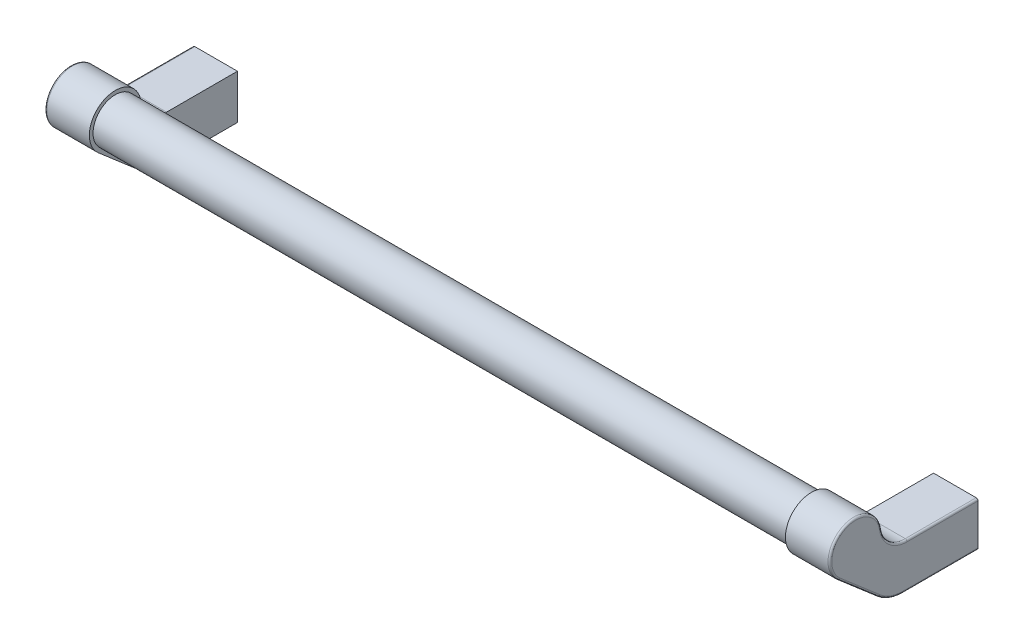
ISO-10303-21;
HEADER;
FILE_DESCRIPTION(('STEP AP214'),'2;1');
FILE_NAME('part.step','',(''),(''),'','','');
FILE_SCHEMA(('AUTOMOTIVE_DESIGN { 1 0 10303 214 1 1 1 1 }'));
ENDSEC;
DATA;
#1=APPLICATION_CONTEXT('core data for automotive mechanical design processes');
#2=APPLICATION_PROTOCOL_DEFINITION('international standard','automotive_design',2000,#1);
#3=PRODUCT_CONTEXT('',#1,'mechanical');
#4=PRODUCT('Part','Part','',(#3));
#5=PRODUCT_RELATED_PRODUCT_CATEGORY('part','',(#4));
#6=PRODUCT_DEFINITION_FORMATION('','',#4);
#7=PRODUCT_DEFINITION_CONTEXT('part definition',#1,'design');
#8=PRODUCT_DEFINITION('design','',#6,#7);
#9=PRODUCT_DEFINITION_SHAPE('','',#8);
#10=(LENGTH_UNIT() NAMED_UNIT(*) SI_UNIT(.MILLI.,.METRE.));
#11=(NAMED_UNIT(*) PLANE_ANGLE_UNIT() SI_UNIT($,.RADIAN.));
#12=(NAMED_UNIT(*) SI_UNIT($,.STERADIAN.) SOLID_ANGLE_UNIT());
#13=UNCERTAINTY_MEASURE_WITH_UNIT(LENGTH_MEASURE(1.E-05),#10,'distance_accuracy_value','');
#14=(GEOMETRIC_REPRESENTATION_CONTEXT(3) GLOBAL_UNCERTAINTY_ASSIGNED_CONTEXT((#13)) GLOBAL_UNIT_ASSIGNED_CONTEXT((#10,
#11,#12)) REPRESENTATION_CONTEXT('',''));
#15=CARTESIAN_POINT('',(0.,0.,0.));
#16=DIRECTION('',(0.,0.,1.));
#17=DIRECTION('',(1.,0.,0.));
#18=AXIS2_PLACEMENT_3D('',#15,#16,#17);
#19=CARTESIAN_POINT('',(200.,0.,6.));
#20=DIRECTION('',(0.,0.,-1.));
#21=DIRECTION('',(-1.,0.,0.));
#22=AXIS2_PLACEMENT_3D('',#19,#20,#21);
#23=PLANE('',#22);
#24=CARTESIAN_POINT('',(200.,0.,6.));
#25=DIRECTION('',(0.,0.,-1.));
#26=DIRECTION('',(-1.,0.,0.));
#27=AXIS2_PLACEMENT_3D('',#24,#25,#26);
#28=CIRCLE('',#27,2.);
#29=CARTESIAN_POINT('',(198.,0.,6.));
#30=VERTEX_POINT('',#29);
#31=EDGE_CURVE('E124',#30,#30,#28,.T.);
#32=ORIENTED_EDGE('',*,*,#31,.T.);
#33=EDGE_LOOP('',(#32));
#34=FACE_BOUND('',#33,.T.);
#35=ADVANCED_FACE('F14',(#34),#23,.T.);
#36=CARTESIAN_POINT('',(205.5,13.,19.143593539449));
#37=DIRECTION('',(-1.,0.,0.));
#38=DIRECTION('',(0.,-1.,0.));
#39=AXIS2_PLACEMENT_3D('',#36,#37,#38);
#40=TOROIDAL_SURFACE('',#39,7.5,0.5);
#41=CARTESIAN_POINT('',(205.5,5.5,19.143593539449));
#42=DIRECTION('',(0.,0.,1.));
#43=DIRECTION('',(1.,0.,0.));
#44=AXIS2_PLACEMENT_3D('',#41,#42,#43);
#45=CIRCLE('',#44,0.5);
#46=CARTESIAN_POINT('',(205.5,6.,19.143593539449));
#47=VERTEX_POINT('',#46);
#48=CARTESIAN_POINT('',(206.,5.5,19.143593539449));
#49=VERTEX_POINT('',#48);
#50=EDGE_CURVE('E275',#47,#49,#45,.F.);
#51=ORIENTED_EDGE('',*,*,#50,.F.);
#52=CARTESIAN_POINT('',(205.5,13.,19.143593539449));
#53=DIRECTION('',(-1.,0.,0.));
#54=DIRECTION('',(0.,-1.,0.));
#55=AXIS2_PLACEMENT_3D('',#52,#53,#54);
#56=CIRCLE('',#55,7.);
#57=CARTESIAN_POINT('',(205.5,12.,26.0717967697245));
#58=VERTEX_POINT('',#57);
#59=EDGE_CURVE('E102',#47,#58,#56,.T.);
#60=ORIENTED_EDGE('',*,*,#59,.T.);
#61=CARTESIAN_POINT('',(205.5,11.9285714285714,26.5666684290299));
#62=DIRECTION('',(0.,0.989743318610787,0.142857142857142));
#63=DIRECTION('',(0.,-0.142857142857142,0.989743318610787));
#64=AXIS2_PLACEMENT_3D('',#61,#62,#63);
#65=CIRCLE('',#64,0.5);
#66=CARTESIAN_POINT('',(206.,11.9285714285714,26.5666684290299));
#67=VERTEX_POINT('',#66);
#68=EDGE_CURVE('E106',#58,#67,#65,.F.);
#69=ORIENTED_EDGE('',*,*,#68,.T.);
#70=CARTESIAN_POINT('',(206.,13.,19.143593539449));
#71=DIRECTION('',(1.,0.,0.));
#72=DIRECTION('',(0.,-0.142857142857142,0.989743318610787));
#73=AXIS2_PLACEMENT_3D('',#70,#71,#72);
#74=CIRCLE('',#73,7.5);
#75=EDGE_CURVE('E292',#67,#49,#74,.T.);
#76=ORIENTED_EDGE('',*,*,#75,.T.);
#77=EDGE_LOOP('',(#51,#60,#69,#76));
#78=FACE_BOUND('',#77,.T.);
#79=ADVANCED_FACE('F161',(#78),#40,.T.);
#80=CARTESIAN_POINT('',(205.5,11.,33.));
#81=DIRECTION('',(-1.,0.,0.));
#82=DIRECTION('',(0.,-1.,0.));
#83=AXIS2_PLACEMENT_3D('',#80,#81,#82);
#84=TOROIDAL_SURFACE('',#83,6.5,0.5);
#85=ORIENTED_EDGE('',*,*,#68,.F.);
#86=CARTESIAN_POINT('',(205.5,11.,33.));
#87=DIRECTION('',(-1.,0.,0.));
#88=DIRECTION('',(0.,-1.,0.));
#89=AXIS2_PLACEMENT_3D('',#86,#87,#88);
#90=CIRCLE('',#89,7.);
#91=CARTESIAN_POINT('',(205.5,5.69800597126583,37.5704331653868));
#92=VERTEX_POINT('',#91);
#93=EDGE_CURVE('E113',#58,#92,#90,.F.);
#94=ORIENTED_EDGE('',*,*,#93,.T.);
#95=CARTESIAN_POINT('',(205.5,6.07671983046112,37.2439736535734));
#96=DIRECTION('',(0.,0.652919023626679,0.757427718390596));
#97=DIRECTION('',(0.,-0.757427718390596,0.652919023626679));
#98=AXIS2_PLACEMENT_3D('',#95,#96,#97);
#99=CIRCLE('',#98,0.5);
#100=CARTESIAN_POINT('',(206.,6.07671983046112,37.2439736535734));
#101=VERTEX_POINT('',#100);
#102=EDGE_CURVE('E116',#92,#101,#99,.T.);
#103=ORIENTED_EDGE('',*,*,#102,.T.);
#104=CARTESIAN_POINT('',(206.,11.,33.));
#105=DIRECTION('',(-1.,0.,0.));
#106=DIRECTION('',(0.,-0.757427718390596,0.652919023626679));
#107=AXIS2_PLACEMENT_3D('',#104,#105,#106);
#108=CIRCLE('',#107,6.5);
#109=EDGE_CURVE('E309',#101,#67,#108,.T.);
#110=ORIENTED_EDGE('',*,*,#109,.T.);
#111=EDGE_LOOP('',(#85,#94,#103,#110));
#112=FACE_BOUND('',#111,.T.);
#113=ADVANCED_FACE('F167',(#112),#84,.T.);
#114=CARTESIAN_POINT('',(205.5,0.0767934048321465,30.2836762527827));
#115=DIRECTION('',(0.,-0.65291902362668,-0.757427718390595));
#116=DIRECTION('',(0.,0.757427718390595,-0.65291902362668));
#117=AXIS2_PLACEMENT_3D('',#114,#115,#116);
#118=CYLINDRICAL_SURFACE('',#117,0.5);
#119=ORIENTED_EDGE('',*,*,#102,.F.);
#120=DIRECTION('',(0.,-0.65291902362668,-0.757427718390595));
#121=VECTOR('',#120,1.);
#122=CARTESIAN_POINT('',(205.5,-0.301920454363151,30.610135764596));
#123=LINE('',#122,#121);
#124=CARTESIAN_POINT('',(205.5,-3.57427718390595,26.8139932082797));
#125=VERTEX_POINT('',#124);
#126=EDGE_CURVE('E119',#92,#125,#123,.T.);
#127=ORIENTED_EDGE('',*,*,#126,.T.);
#128=CARTESIAN_POINT('',(205.5,-3.19556332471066,26.4875336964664));
#129=DIRECTION('',(0.,-0.65291902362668,-0.757427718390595));
#130=DIRECTION('',(0.,0.757427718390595,-0.65291902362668));
#131=AXIS2_PLACEMENT_3D('',#128,#129,#130);
#132=CIRCLE('',#131,0.5);
#133=CARTESIAN_POINT('',(206.,-3.19556332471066,26.4875336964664));
#134=VERTEX_POINT('',#133);
#135=EDGE_CURVE('E122',#125,#134,#132,.F.);
#136=ORIENTED_EDGE('',*,*,#135,.T.);
#137=DIRECTION('',(0.,0.65291902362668,0.757427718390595));
#138=VECTOR('',#137,1.);
#139=CARTESIAN_POINT('',(206.,-3.19556332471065,26.4875336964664));
#140=LINE('',#139,#138);
#141=EDGE_CURVE('E316',#134,#101,#140,.T.);
#142=ORIENTED_EDGE('',*,*,#141,.T.);
#143=EDGE_LOOP('',(#119,#127,#136,#142));
#144=FACE_BOUND('',#143,.T.);
#145=ADVANCED_FACE('F221',(#144),#118,.T.);
#146=CARTESIAN_POINT('',(205.5,4.,20.284802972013));
#147=DIRECTION('',(-1.,0.,0.));
#148=DIRECTION('',(0.,-1.,0.));
#149=AXIS2_PLACEMENT_3D('',#146,#147,#148);
#150=TOROIDAL_SURFACE('',#149,9.5,0.5);
#151=ORIENTED_EDGE('',*,*,#135,.F.);
#152=CARTESIAN_POINT('',(205.5,4.,20.284802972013));
#153=DIRECTION('',(-1.,0.,0.));
#154=DIRECTION('',(0.,-1.,0.));
#155=AXIS2_PLACEMENT_3D('',#152,#153,#154);
#156=CIRCLE('',#155,10.);
#157=CARTESIAN_POINT('',(205.5,-6.,20.284802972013));
#158=VERTEX_POINT('',#157);
#159=EDGE_CURVE('E125',#125,#158,#156,.F.);
#160=ORIENTED_EDGE('',*,*,#159,.T.);
#161=CARTESIAN_POINT('',(205.5,-5.5,20.284802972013));
#162=DIRECTION('',(0.,0.,1.));
#163=DIRECTION('',(0.,-1.,0.));
#164=AXIS2_PLACEMENT_3D('',#161,#162,#163);
#165=CIRCLE('',#164,0.5);
#166=CARTESIAN_POINT('',(206.,-5.5,20.284802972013));
#167=VERTEX_POINT('',#166);
#168=EDGE_CURVE('E126',#158,#167,#165,.T.);
#169=ORIENTED_EDGE('',*,*,#168,.T.);
#170=CARTESIAN_POINT('',(206.,4.,20.284802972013));
#171=DIRECTION('',(-1.,0.,0.));
#172=DIRECTION('',(0.,-1.,0.));
#173=AXIS2_PLACEMENT_3D('',#170,#171,#172);
#174=CIRCLE('',#173,9.5);
#175=EDGE_CURVE('E262',#167,#134,#174,.T.);
#176=ORIENTED_EDGE('',*,*,#175,.T.);
#177=EDGE_LOOP('',(#151,#160,#169,#176));
#178=FACE_BOUND('',#177,.T.);
#179=ADVANCED_FACE('F215',(#178),#150,.T.);
#180=CARTESIAN_POINT('',(205.5,-5.5,19.143593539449));
#181=DIRECTION('',(0.,0.,-1.));
#182=DIRECTION('',(-1.,0.,0.));
#183=AXIS2_PLACEMENT_3D('',#180,#181,#182);
#184=CYLINDRICAL_SURFACE('',#183,0.5);
#185=ORIENTED_EDGE('',*,*,#168,.F.);
#186=DIRECTION('',(0.,0.,-1.));
#187=VECTOR('',#186,1.);
#188=CARTESIAN_POINT('',(205.5,-6.,19.143593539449));
#189=LINE('',#188,#187);
#190=CARTESIAN_POINT('',(205.5,-6.,0.));
#191=VERTEX_POINT('',#190);
#192=EDGE_CURVE('E86',#158,#191,#189,.T.);
#193=ORIENTED_EDGE('',*,*,#192,.T.);
#194=CARTESIAN_POINT('',(205.5,-5.5,0.));
#195=DIRECTION('',(0.,0.,-1.));
#196=DIRECTION('',(-1.,0.,0.));
#197=AXIS2_PLACEMENT_3D('',#194,#195,#196);
#198=CIRCLE('',#197,0.5);
#199=CARTESIAN_POINT('',(206.,-5.5,0.));
#200=VERTEX_POINT('',#199);
#201=EDGE_CURVE('E130',#191,#200,#198,.F.);
#202=ORIENTED_EDGE('',*,*,#201,.T.);
#203=DIRECTION('',(0.,0.,1.));
#204=VECTOR('',#203,1.);
#205=CARTESIAN_POINT('',(206.,-5.5,19.143593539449));
#206=LINE('',#205,#204);
#207=EDGE_CURVE('E319',#200,#167,#206,.T.);
#208=ORIENTED_EDGE('',*,*,#207,.T.);
#209=EDGE_LOOP('',(#185,#193,#202,#208));
#210=FACE_BOUND('',#209,.T.);
#211=ADVANCED_FACE('F184',(#210),#184,.T.);
#212=CARTESIAN_POINT('',(206.,13.,19.143593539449));
#213=DIRECTION('',(-1.,0.,0.));
#214=DIRECTION('',(0.,-1.,0.));
#215=AXIS2_PLACEMENT_3D('',#212,#213,#214);
#216=PLANE('',#215);
#217=DIRECTION('',(0.,0.,1.));
#218=VECTOR('',#217,1.);
#219=CARTESIAN_POINT('',(206.,5.5,19.143593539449));
#220=LINE('',#219,#218);
#221=CARTESIAN_POINT('',(206.,5.5,0.));
#222=VERTEX_POINT('',#221);
#223=EDGE_CURVE('E312',#49,#222,#220,.F.);
#224=ORIENTED_EDGE('',*,*,#223,.F.);
#225=ORIENTED_EDGE('',*,*,#75,.F.);
#226=ORIENTED_EDGE('',*,*,#109,.F.);
#227=ORIENTED_EDGE('',*,*,#141,.F.);
#228=ORIENTED_EDGE('',*,*,#175,.F.);
#229=ORIENTED_EDGE('',*,*,#207,.F.);
#230=DIRECTION('',(0.,-1.,0.));
#231=VECTOR('',#230,1.);
#232=CARTESIAN_POINT('',(206.,13.,0.));
#233=LINE('',#232,#231);
#234=EDGE_CURVE('E139',#222,#200,#233,.T.);
#235=ORIENTED_EDGE('',*,*,#234,.F.);
#236=EDGE_LOOP('',(#224,#225,#226,#227,#228,#229,#235));
#237=FACE_BOUND('',#236,.T.);
#238=ADVANCED_FACE('F175',(#237),#216,.F.);
#239=CARTESIAN_POINT('',(200.,0.,6.));
#240=DIRECTION('',(0.,0.,-1.));
#241=DIRECTION('',(-1.,0.,0.));
#242=AXIS2_PLACEMENT_3D('',#239,#240,#241);
#243=CYLINDRICAL_SURFACE('',#242,2.);
#244=CARTESIAN_POINT('',(200.,0.,0.400000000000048));
#245=DIRECTION('',(0.,0.,1.));
#246=DIRECTION('',(1.,0.,0.));
#247=AXIS2_PLACEMENT_3D('',#244,#245,#246);
#248=CIRCLE('',#247,2.);
#249=CARTESIAN_POINT('',(202.,0.,0.400000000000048));
#250=VERTEX_POINT('',#249);
#251=EDGE_CURVE('E23',#250,#250,#248,.F.);
#252=ORIENTED_EDGE('',*,*,#251,.T.);
#253=EDGE_LOOP('',(#252));
#254=FACE_BOUND('',#253,.T.);
#255=ORIENTED_EDGE('',*,*,#31,.F.);
#256=EDGE_LOOP('',(#255));
#257=FACE_BOUND('',#256,.T.);
#258=ADVANCED_FACE('F147',(#254,#257),#243,.F.);
#259=CARTESIAN_POINT('',(205.5,5.5,19.143593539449));
#260=DIRECTION('',(0.,0.,1.));
#261=DIRECTION('',(1.,0.,0.));
#262=AXIS2_PLACEMENT_3D('',#259,#260,#261);
#263=CYLINDRICAL_SURFACE('',#262,0.5);
#264=ORIENTED_EDGE('',*,*,#50,.T.);
#265=ORIENTED_EDGE('',*,*,#223,.T.);
#266=CARTESIAN_POINT('',(205.5,5.5,0.));
#267=DIRECTION('',(0.,0.,1.));
#268=DIRECTION('',(1.,0.,0.));
#269=AXIS2_PLACEMENT_3D('',#266,#267,#268);
#270=CIRCLE('',#269,0.5);
#271=CARTESIAN_POINT('',(205.5,6.,0.));
#272=VERTEX_POINT('',#271);
#273=EDGE_CURVE('E31',#222,#272,#270,.T.);
#274=ORIENTED_EDGE('',*,*,#273,.T.);
#275=DIRECTION('',(0.,0.,1.));
#276=VECTOR('',#275,1.);
#277=CARTESIAN_POINT('',(205.5,6.,19.143593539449));
#278=LINE('',#277,#276);
#279=EDGE_CURVE('E105',#272,#47,#278,.T.);
#280=ORIENTED_EDGE('',*,*,#279,.T.);
#281=EDGE_LOOP('',(#264,#265,#274,#280));
#282=FACE_BOUND('',#281,.T.);
#283=ADVANCED_FACE('F170',(#282),#263,.T.);
#284=CARTESIAN_POINT('',(206.,13.,19.143593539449));
#285=DIRECTION('',(-1.,0.,0.));
#286=DIRECTION('',(0.,-1.,0.));
#287=AXIS2_PLACEMENT_3D('',#284,#285,#286);
#288=CYLINDRICAL_SURFACE('',#287,7.);
#289=ORIENTED_EDGE('',*,*,#59,.F.);
#290=DIRECTION('',(1.,0.,0.));
#291=VECTOR('',#290,1.);
#292=CARTESIAN_POINT('',(206.,6.,19.143593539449));
#293=LINE('',#292,#291);
#294=CARTESIAN_POINT('',(194.,6.,19.143593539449));
#295=VERTEX_POINT('',#294);
#296=EDGE_CURVE('E107',#47,#295,#293,.F.);
#297=ORIENTED_EDGE('',*,*,#296,.T.);
#298=CARTESIAN_POINT('',(194.,13.,19.143593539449));
#299=DIRECTION('',(-1.,0.,0.));
#300=DIRECTION('',(0.,-1.,0.));
#301=AXIS2_PLACEMENT_3D('',#298,#299,#300);
#302=CIRCLE('',#301,7.);
#303=CARTESIAN_POINT('',(194.,12.,26.0717967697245));
#304=VERTEX_POINT('',#303);
#305=EDGE_CURVE('E95',#304,#295,#302,.F.);
#306=ORIENTED_EDGE('',*,*,#305,.F.);
#307=DIRECTION('',(-1.,0.,0.));
#308=VECTOR('',#307,1.);
#309=CARTESIAN_POINT('',(206.,12.,26.0717967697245));
#310=LINE('',#309,#308);
#311=EDGE_CURVE('E78',#58,#304,#310,.T.);
#312=ORIENTED_EDGE('',*,*,#311,.F.);
#313=EDGE_LOOP('',(#289,#297,#306,#312));
#314=FACE_BOUND('',#313,.T.);
#315=ADVANCED_FACE('F180',(#314),#288,.F.);
#316=CARTESIAN_POINT('',(206.,11.,33.));
#317=DIRECTION('',(-1.,0.,0.));
#318=DIRECTION('',(0.,-1.,0.));
#319=AXIS2_PLACEMENT_3D('',#316,#317,#318);
#320=CYLINDRICAL_SURFACE('',#319,7.);
#321=ORIENTED_EDGE('',*,*,#311,.T.);
#322=CARTESIAN_POINT('',(194.,11.,33.));
#323=DIRECTION('',(-1.,0.,0.));
#324=DIRECTION('',(0.,-1.,0.));
#325=AXIS2_PLACEMENT_3D('',#322,#323,#324);
#326=CIRCLE('',#325,7.);
#327=CARTESIAN_POINT('',(194.,5.69800597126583,37.5704331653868));
#328=VERTEX_POINT('',#327);
#329=EDGE_CURVE('E97',#328,#304,#326,.T.);
#330=ORIENTED_EDGE('',*,*,#329,.F.);
#331=DIRECTION('',(-1.,0.,0.));
#332=VECTOR('',#331,1.);
#333=CARTESIAN_POINT('',(206.,5.69800597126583,37.5704331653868));
#334=LINE('',#333,#332);
#335=EDGE_CURVE('E112',#328,#92,#334,.F.);
#336=ORIENTED_EDGE('',*,*,#335,.T.);
#337=ORIENTED_EDGE('',*,*,#93,.F.);
#338=EDGE_LOOP('',(#321,#330,#336,#337));
#339=FACE_BOUND('',#338,.T.);
#340=ADVANCED_FACE('F197',(#339),#320,.T.);
#341=CARTESIAN_POINT('',(206.,-3.57427718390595,26.8139932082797));
#342=DIRECTION('',(0.,0.757427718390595,-0.65291902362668));
#343=DIRECTION('',(0.,0.65291902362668,0.757427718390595));
#344=AXIS2_PLACEMENT_3D('',#341,#342,#343);
#345=PLANE('',#344);
#346=ORIENTED_EDGE('',*,*,#126,.F.);
#347=ORIENTED_EDGE('',*,*,#335,.F.);
#348=DIRECTION('',(0.,0.65291902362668,0.757427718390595));
#349=VECTOR('',#348,1.);
#350=CARTESIAN_POINT('',(194.,-3.57427718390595,26.8139932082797));
#351=LINE('',#350,#349);
#352=CARTESIAN_POINT('',(194.,-3.57427718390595,26.8139932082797));
#353=VERTEX_POINT('',#352);
#354=EDGE_CURVE('E77',#353,#328,#351,.T.);
#355=ORIENTED_EDGE('',*,*,#354,.F.);
#356=DIRECTION('',(1.,0.,0.));
#357=VECTOR('',#356,1.);
#358=CARTESIAN_POINT('',(206.,-3.57427718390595,26.8139932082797));
#359=LINE('',#358,#357);
#360=EDGE_CURVE('E73',#125,#353,#359,.F.);
#361=ORIENTED_EDGE('',*,*,#360,.F.);
#362=EDGE_LOOP('',(#346,#347,#355,#361));
#363=FACE_BOUND('',#362,.T.);
#364=ADVANCED_FACE('F190',(#363),#345,.F.);
#365=CARTESIAN_POINT('',(206.,4.,20.284802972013));
#366=DIRECTION('',(-1.,0.,0.));
#367=DIRECTION('',(0.,-1.,0.));
#368=AXIS2_PLACEMENT_3D('',#365,#366,#367);
#369=CYLINDRICAL_SURFACE('',#368,10.);
#370=ORIENTED_EDGE('',*,*,#360,.T.);
#371=CARTESIAN_POINT('',(194.,4.,20.284802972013));
#372=DIRECTION('',(-1.,0.,0.));
#373=DIRECTION('',(0.,-1.,0.));
#374=AXIS2_PLACEMENT_3D('',#371,#372,#373);
#375=CIRCLE('',#374,10.);
#376=CARTESIAN_POINT('',(194.,-6.,20.284802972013));
#377=VERTEX_POINT('',#376);
#378=EDGE_CURVE('E66',#377,#353,#375,.T.);
#379=ORIENTED_EDGE('',*,*,#378,.F.);
#380=DIRECTION('',(-1.,0.,0.));
#381=VECTOR('',#380,1.);
#382=CARTESIAN_POINT('',(206.,-6.,20.284802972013));
#383=LINE('',#382,#381);
#384=EDGE_CURVE('E70',#377,#158,#383,.F.);
#385=ORIENTED_EDGE('',*,*,#384,.T.);
#386=ORIENTED_EDGE('',*,*,#159,.F.);
#387=EDGE_LOOP('',(#370,#379,#385,#386));
#388=FACE_BOUND('',#387,.T.);
#389=ADVANCED_FACE('F68',(#388),#369,.T.);
#390=CARTESIAN_POINT('',(206.,-6.,20.284802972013));
#391=DIRECTION('',(0.,1.,0.));
#392=DIRECTION('',(-1.,0.,0.));
#393=AXIS2_PLACEMENT_3D('',#390,#391,#392);
#394=PLANE('',#393);
#395=ORIENTED_EDGE('',*,*,#192,.F.);
#396=ORIENTED_EDGE('',*,*,#384,.F.);
#397=DIRECTION('',(0.,0.,1.));
#398=VECTOR('',#397,1.);
#399=CARTESIAN_POINT('',(194.,-6.,20.284802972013));
#400=LINE('',#399,#398);
#401=CARTESIAN_POINT('',(194.,-6.,0.));
#402=VERTEX_POINT('',#401);
#403=EDGE_CURVE('E84',#402,#377,#400,.T.);
#404=ORIENTED_EDGE('',*,*,#403,.F.);
#405=DIRECTION('',(1.,0.,0.));
#406=VECTOR('',#405,1.);
#407=CARTESIAN_POINT('',(206.,-6.,0.));
#408=LINE('',#407,#406);
#409=EDGE_CURVE('E132',#402,#191,#408,.T.);
#410=ORIENTED_EDGE('',*,*,#409,.T.);
#411=EDGE_LOOP('',(#395,#396,#404,#410));
#412=FACE_BOUND('',#411,.T.);
#413=ADVANCED_FACE('F82',(#412),#394,.F.);
#414=CARTESIAN_POINT('',(206.,-6.,0.));
#415=DIRECTION('',(0.,0.,1.));
#416=DIRECTION('',(1.,0.,0.));
#417=AXIS2_PLACEMENT_3D('',#414,#415,#416);
#418=PLANE('',#417);
#419=CARTESIAN_POINT('',(200.,0.,0.));
#420=DIRECTION('',(0.,0.,1.));
#421=DIRECTION('',(1.,0.,0.));
#422=AXIS2_PLACEMENT_3D('',#419,#420,#421);
#423=CIRCLE('',#422,2.40000000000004);
#424=CARTESIAN_POINT('',(202.4,0.,0.));
#425=VERTEX_POINT('',#424);
#426=EDGE_CURVE('E9',#425,#425,#423,.T.);
#427=ORIENTED_EDGE('',*,*,#426,.T.);
#428=EDGE_LOOP('',(#427));
#429=FACE_BOUND('',#428,.T.);
#430=ORIENTED_EDGE('',*,*,#273,.F.);
#431=ORIENTED_EDGE('',*,*,#234,.T.);
#432=ORIENTED_EDGE('',*,*,#201,.F.);
#433=ORIENTED_EDGE('',*,*,#409,.F.);
#434=DIRECTION('',(0.,1.,0.));
#435=VECTOR('',#434,1.);
#436=CARTESIAN_POINT('',(194.,-6.,0.));
#437=LINE('',#436,#435);
#438=CARTESIAN_POINT('',(194.,6.,0.));
#439=VERTEX_POINT('',#438);
#440=EDGE_CURVE('E94',#439,#402,#437,.F.);
#441=ORIENTED_EDGE('',*,*,#440,.F.);
#442=DIRECTION('',(1.,0.,0.));
#443=VECTOR('',#442,1.);
#444=CARTESIAN_POINT('',(206.,6.,0.));
#445=LINE('',#444,#443);
#446=EDGE_CURVE('E129',#272,#439,#445,.F.);
#447=ORIENTED_EDGE('',*,*,#446,.F.);
#448=EDGE_LOOP('',(#430,#431,#432,#433,#441,#447));
#449=FACE_BOUND('',#448,.T.);
#450=ADVANCED_FACE('F183',(#429,#449),#418,.F.);
#451=CARTESIAN_POINT('',(206.,6.,0.));
#452=DIRECTION('',(0.,-1.,0.));
#453=DIRECTION('',(1.,0.,0.));
#454=AXIS2_PLACEMENT_3D('',#451,#452,#453);
#455=PLANE('',#454);
#456=ORIENTED_EDGE('',*,*,#279,.F.);
#457=ORIENTED_EDGE('',*,*,#446,.T.);
#458=DIRECTION('',(0.,0.,1.));
#459=VECTOR('',#458,1.);
#460=CARTESIAN_POINT('',(194.,6.,0.));
#461=LINE('',#460,#459);
#462=EDGE_CURVE('E88',#295,#439,#461,.F.);
#463=ORIENTED_EDGE('',*,*,#462,.F.);
#464=ORIENTED_EDGE('',*,*,#296,.F.);
#465=EDGE_LOOP('',(#456,#457,#463,#464));
#466=FACE_BOUND('',#465,.T.);
#467=ADVANCED_FACE('F196',(#466),#455,.F.);
#468=CARTESIAN_POINT('',(194.,13.,19.143593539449));
#469=DIRECTION('',(-1.,0.,0.));
#470=DIRECTION('',(0.,-1.,0.));
#471=AXIS2_PLACEMENT_3D('',#468,#469,#470);
#472=PLANE('',#471);
#473=CARTESIAN_POINT('',(194.,11.,33.));
#474=DIRECTION('',(-1.,0.,0.));
#475=DIRECTION('',(0.,-1.,0.));
#476=AXIS2_PLACEMENT_3D('',#473,#474,#475);
#477=CIRCLE('',#476,6.);
#478=CARTESIAN_POINT('',(194.,5.,33.));
#479=VERTEX_POINT('',#478);
#480=EDGE_CURVE('E135',#479,#479,#477,.T.);
#481=ORIENTED_EDGE('',*,*,#480,.F.);
#482=EDGE_LOOP('',(#481));
#483=FACE_BOUND('',#482,.T.);
#484=ORIENTED_EDGE('',*,*,#462,.T.);
#485=ORIENTED_EDGE('',*,*,#440,.T.);
#486=ORIENTED_EDGE('',*,*,#403,.T.);
#487=ORIENTED_EDGE('',*,*,#378,.T.);
#488=ORIENTED_EDGE('',*,*,#354,.T.);
#489=ORIENTED_EDGE('',*,*,#329,.T.);
#490=ORIENTED_EDGE('',*,*,#305,.T.);
#491=EDGE_LOOP('',(#484,#485,#486,#487,#488,#489,#490));
#492=FACE_BOUND('',#491,.T.);
#493=ADVANCED_FACE('F92',(#483,#492),#472,.T.);
#494=CARTESIAN_POINT('',(194.,11.,33.));
#495=DIRECTION('',(-1.,0.,0.));
#496=DIRECTION('',(0.,-1.,0.));
#497=AXIS2_PLACEMENT_3D('',#494,#495,#496);
#498=CYLINDRICAL_SURFACE('',#497,6.);
#499=ORIENTED_EDGE('',*,*,#480,.T.);
#500=EDGE_LOOP('',(#499));
#501=FACE_BOUND('',#500,.T.);
#502=CARTESIAN_POINT('',(6.,11.,33.));
#503=DIRECTION('',(-1.,0.,0.));
#504=DIRECTION('',(0.,-1.,0.));
#505=AXIS2_PLACEMENT_3D('',#502,#503,#504);
#506=CIRCLE('',#505,6.);
#507=CARTESIAN_POINT('',(6.,5.,33.));
#508=VERTEX_POINT('',#507);
#509=EDGE_CURVE('E676',#508,#508,#506,.T.);
#510=ORIENTED_EDGE('',*,*,#509,.F.);
#511=EDGE_LOOP('',(#510));
#512=FACE_BOUND('',#511,.T.);
#513=ADVANCED_FACE('F187',(#501,#512),#498,.T.);
#514=CARTESIAN_POINT('',(0.,0.,6.));
#515=DIRECTION('',(0.,0.,-1.));
#516=DIRECTION('',(-1.,0.,0.));
#517=AXIS2_PLACEMENT_3D('',#514,#515,#516);
#518=PLANE('',#517);
#519=CARTESIAN_POINT('',(0.,0.,6.));
#520=DIRECTION('',(0.,0.,-1.));
#521=DIRECTION('',(-1.,0.,0.));
#522=AXIS2_PLACEMENT_3D('',#519,#520,#521);
#523=CIRCLE('',#522,2.);
#524=CARTESIAN_POINT('',(-2.,0.,6.));
#525=VERTEX_POINT('',#524);
#526=EDGE_CURVE('E659',#525,#525,#523,.T.);
#527=ORIENTED_EDGE('',*,*,#526,.T.);
#528=EDGE_LOOP('',(#527));
#529=FACE_BOUND('',#528,.T.);
#530=ADVANCED_FACE('F466',(#529),#518,.T.);
#531=CARTESIAN_POINT('',(-5.5,4.,20.284802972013));
#532=DIRECTION('',(-1.,0.,0.));
#533=DIRECTION('',(0.,-1.,0.));
#534=AXIS2_PLACEMENT_3D('',#531,#532,#533);
#535=TOROIDAL_SURFACE('',#534,9.5,0.5);
#536=CARTESIAN_POINT('',(-5.5,-3.19556332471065,26.4875336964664));
#537=DIRECTION('',(0.,0.65291902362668,0.757427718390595));
#538=DIRECTION('',(0.,-0.757427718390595,0.65291902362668));
#539=AXIS2_PLACEMENT_3D('',#536,#537,#538);
#540=CIRCLE('',#539,0.5);
#541=CARTESIAN_POINT('',(-6.,-3.19556332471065,26.4875336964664));
#542=VERTEX_POINT('',#541);
#543=CARTESIAN_POINT('',(-5.5,-3.57427718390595,26.8139932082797));
#544=VERTEX_POINT('',#543);
#545=EDGE_CURVE('E717',#542,#544,#540,.T.);
#546=ORIENTED_EDGE('',*,*,#545,.F.);
#547=CARTESIAN_POINT('',(-6.,4.,20.284802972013));
#548=DIRECTION('',(1.,0.,0.));
#549=DIRECTION('',(0.,-0.757427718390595,0.65291902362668));
#550=AXIS2_PLACEMENT_3D('',#547,#548,#549);
#551=CIRCLE('',#550,9.50000000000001);
#552=CARTESIAN_POINT('',(-6.,-5.5,20.284802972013));
#553=VERTEX_POINT('',#552);
#554=EDGE_CURVE('E848',#553,#542,#551,.F.);
#555=ORIENTED_EDGE('',*,*,#554,.F.);
#556=CARTESIAN_POINT('',(-5.5,-5.5,20.284802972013));
#557=DIRECTION('',(0.,0.,1.));
#558=DIRECTION('',(0.,-1.,0.));
#559=AXIS2_PLACEMENT_3D('',#556,#557,#558);
#560=CIRCLE('',#559,0.5);
#561=CARTESIAN_POINT('',(-5.5,-6.,20.284802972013));
#562=VERTEX_POINT('',#561);
#563=EDGE_CURVE('E711',#553,#562,#560,.T.);
#564=ORIENTED_EDGE('',*,*,#563,.T.);
#565=CARTESIAN_POINT('',(-5.5,4.,20.284802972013));
#566=DIRECTION('',(-1.,0.,0.));
#567=DIRECTION('',(0.,-1.,0.));
#568=AXIS2_PLACEMENT_3D('',#565,#566,#567);
#569=CIRCLE('',#568,10.);
#570=EDGE_CURVE('E714',#562,#544,#569,.T.);
#571=ORIENTED_EDGE('',*,*,#570,.T.);
#572=EDGE_LOOP('',(#546,#555,#564,#571));
#573=FACE_BOUND('',#572,.T.);
#574=ADVANCED_FACE('F475',(#573),#535,.T.);
#575=CARTESIAN_POINT('',(-5.5,-3.19556332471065,26.4875336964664));
#576=DIRECTION('',(0.,0.65291902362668,0.757427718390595));
#577=DIRECTION('',(0.,-0.757427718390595,0.65291902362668));
#578=AXIS2_PLACEMENT_3D('',#575,#576,#577);
#579=CYLINDRICAL_SURFACE('',#578,0.5);
#580=CARTESIAN_POINT('',(-5.5,6.07671983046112,37.2439736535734));
#581=DIRECTION('',(0.,0.652919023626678,0.757427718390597));
#582=DIRECTION('',(0.,-0.757427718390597,0.652919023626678));
#583=AXIS2_PLACEMENT_3D('',#580,#581,#582);
#584=CIRCLE('',#583,0.5);
#585=CARTESIAN_POINT('',(-6.,6.07671983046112,37.2439736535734));
#586=VERTEX_POINT('',#585);
#587=CARTESIAN_POINT('',(-5.5,5.69800597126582,37.5704331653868));
#588=VERTEX_POINT('',#587);
#589=EDGE_CURVE('E724',#586,#588,#584,.T.);
#590=ORIENTED_EDGE('',*,*,#589,.F.);
#591=DIRECTION('',(0.,0.65291902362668,0.757427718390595));
#592=VECTOR('',#591,1.);
#593=CARTESIAN_POINT('',(-6.,-3.19556332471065,26.4875336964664));
#594=LINE('',#593,#592);
#595=EDGE_CURVE('E839',#542,#586,#594,.T.);
#596=ORIENTED_EDGE('',*,*,#595,.F.);
#597=ORIENTED_EDGE('',*,*,#545,.T.);
#598=DIRECTION('',(0.,0.65291902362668,0.757427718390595));
#599=VECTOR('',#598,1.);
#600=CARTESIAN_POINT('',(-5.5,-3.57427718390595,26.8139932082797));
#601=LINE('',#600,#599);
#602=EDGE_CURVE('E721',#544,#588,#601,.T.);
#603=ORIENTED_EDGE('',*,*,#602,.T.);
#604=EDGE_LOOP('',(#590,#596,#597,#603));
#605=FACE_BOUND('',#604,.T.);
#606=ADVANCED_FACE('F484',(#605),#579,.T.);
#607=CARTESIAN_POINT('',(-5.5,11.,33.));
#608=DIRECTION('',(-1.,0.,0.));
#609=DIRECTION('',(0.,-1.,0.));
#610=AXIS2_PLACEMENT_3D('',#607,#608,#609);
#611=TOROIDAL_SURFACE('',#610,6.5,0.5);
#612=CARTESIAN_POINT('',(-5.5,11.9285714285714,26.5666684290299));
#613=DIRECTION('',(0.,-0.989743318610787,-0.142857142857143));
#614=DIRECTION('',(0.,0.142857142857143,-0.989743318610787));
#615=AXIS2_PLACEMENT_3D('',#612,#613,#614);
#616=CIRCLE('',#615,0.5);
#617=CARTESIAN_POINT('',(-5.5,12.,26.0717967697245));
#618=VERTEX_POINT('',#617);
#619=CARTESIAN_POINT('',(-6.,11.9285714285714,26.5666684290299));
#620=VERTEX_POINT('',#619);
#621=EDGE_CURVE('E732',#618,#620,#616,.F.);
#622=ORIENTED_EDGE('',*,*,#621,.T.);
#623=CARTESIAN_POINT('',(-6.,11.,33.));
#624=DIRECTION('',(1.,0.,0.));
#625=DIRECTION('',(0.,0.142857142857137,-0.989743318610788));
#626=AXIS2_PLACEMENT_3D('',#623,#624,#625);
#627=CIRCLE('',#626,6.50000000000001);
#628=EDGE_CURVE('E842',#586,#620,#627,.F.);
#629=ORIENTED_EDGE('',*,*,#628,.F.);
#630=ORIENTED_EDGE('',*,*,#589,.T.);
#631=CARTESIAN_POINT('',(-5.5,11.,33.));
#632=DIRECTION('',(-1.,0.,0.));
#633=DIRECTION('',(0.,-1.,0.));
#634=AXIS2_PLACEMENT_3D('',#631,#632,#633);
#635=CIRCLE('',#634,7.);
#636=EDGE_CURVE('E729',#588,#618,#635,.T.);
#637=ORIENTED_EDGE('',*,*,#636,.T.);
#638=EDGE_LOOP('',(#622,#629,#630,#637));
#639=FACE_BOUND('',#638,.T.);
#640=ADVANCED_FACE('F494',(#639),#611,.T.);
#641=CARTESIAN_POINT('',(-5.5,13.,19.143593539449));
#642=DIRECTION('',(-1.,0.,0.));
#643=DIRECTION('',(0.,-1.,0.));
#644=AXIS2_PLACEMENT_3D('',#641,#642,#643);
#645=TOROIDAL_SURFACE('',#644,7.5,0.5);
#646=CARTESIAN_POINT('',(-5.5,5.5,19.143593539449));
#647=DIRECTION('',(0.,0.,-1.));
#648=DIRECTION('',(-1.,0.,0.));
#649=AXIS2_PLACEMENT_3D('',#646,#647,#648);
#650=CIRCLE('',#649,0.5);
#651=CARTESIAN_POINT('',(-6.,5.5,19.143593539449));
#652=VERTEX_POINT('',#651);
#653=CARTESIAN_POINT('',(-5.5,6.,19.143593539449));
#654=VERTEX_POINT('',#653);
#655=EDGE_CURVE('E708',#652,#654,#650,.T.);
#656=ORIENTED_EDGE('',*,*,#655,.F.);
#657=CARTESIAN_POINT('',(-6.,13.,19.143593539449));
#658=DIRECTION('',(-1.,0.,0.));
#659=DIRECTION('',(0.,-1.,0.));
#660=AXIS2_PLACEMENT_3D('',#657,#658,#659);
#661=CIRCLE('',#660,7.5);
#662=EDGE_CURVE('E748',#620,#652,#661,.F.);
#663=ORIENTED_EDGE('',*,*,#662,.F.);
#664=ORIENTED_EDGE('',*,*,#621,.F.);
#665=CARTESIAN_POINT('',(-5.5,13.,19.143593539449));
#666=DIRECTION('',(-1.,0.,0.));
#667=DIRECTION('',(0.,-1.,0.));
#668=AXIS2_PLACEMENT_3D('',#665,#666,#667);
#669=CIRCLE('',#668,7.);
#670=EDGE_CURVE('E686',#618,#654,#669,.F.);
#671=ORIENTED_EDGE('',*,*,#670,.T.);
#672=EDGE_LOOP('',(#656,#663,#664,#671));
#673=FACE_BOUND('',#672,.T.);
#674=ADVANCED_FACE('F504',(#673),#645,.T.);
#675=CARTESIAN_POINT('',(-6.,13.,19.143593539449));
#676=DIRECTION('',(-1.,0.,0.));
#677=DIRECTION('',(0.,-1.,0.));
#678=AXIS2_PLACEMENT_3D('',#675,#676,#677);
#679=PLANE('',#678);
#680=ORIENTED_EDGE('',*,*,#595,.T.);
#681=ORIENTED_EDGE('',*,*,#628,.T.);
#682=ORIENTED_EDGE('',*,*,#662,.T.);
#683=DIRECTION('',(0.,0.,1.));
#684=VECTOR('',#683,1.);
#685=CARTESIAN_POINT('',(-6.,5.5,19.143593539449));
#686=LINE('',#685,#684);
#687=CARTESIAN_POINT('',(-6.,5.5,0.));
#688=VERTEX_POINT('',#687);
#689=EDGE_CURVE('E757',#652,#688,#686,.F.);
#690=ORIENTED_EDGE('',*,*,#689,.T.);
#691=DIRECTION('',(0.,-1.,0.));
#692=VECTOR('',#691,1.);
#693=CARTESIAN_POINT('',(-6.,13.,0.));
#694=LINE('',#693,#692);
#695=CARTESIAN_POINT('',(-6.,-5.5,0.));
#696=VERTEX_POINT('',#695);
#697=EDGE_CURVE('E754',#688,#696,#694,.T.);
#698=ORIENTED_EDGE('',*,*,#697,.T.);
#699=DIRECTION('',(0.,0.,1.));
#700=VECTOR('',#699,1.);
#701=CARTESIAN_POINT('',(-6.,-5.5,19.143593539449));
#702=LINE('',#701,#700);
#703=EDGE_CURVE('E758',#696,#553,#702,.T.);
#704=ORIENTED_EDGE('',*,*,#703,.T.);
#705=ORIENTED_EDGE('',*,*,#554,.T.);
#706=EDGE_LOOP('',(#680,#681,#682,#690,#698,#704,#705));
#707=FACE_BOUND('',#706,.T.);
#708=ADVANCED_FACE('F514',(#707),#679,.T.);
#709=CARTESIAN_POINT('',(-5.5,-5.5,20.284802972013));
#710=DIRECTION('',(0.,0.,1.));
#711=DIRECTION('',(1.,0.,0.));
#712=AXIS2_PLACEMENT_3D('',#709,#710,#711);
#713=CYLINDRICAL_SURFACE('',#712,0.5);
#714=ORIENTED_EDGE('',*,*,#563,.F.);
#715=ORIENTED_EDGE('',*,*,#703,.F.);
#716=CARTESIAN_POINT('',(-5.5,-5.5,0.));
#717=DIRECTION('',(0.,0.,1.));
#718=DIRECTION('',(1.,0.,0.));
#719=AXIS2_PLACEMENT_3D('',#716,#717,#718);
#720=CIRCLE('',#719,0.5);
#721=CARTESIAN_POINT('',(-5.5,-6.,0.));
#722=VERTEX_POINT('',#721);
#723=EDGE_CURVE('E690',#696,#722,#720,.T.);
#724=ORIENTED_EDGE('',*,*,#723,.T.);
#725=DIRECTION('',(0.,0.,1.));
#726=VECTOR('',#725,1.);
#727=CARTESIAN_POINT('',(-5.5,-6.,20.284802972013));
#728=LINE('',#727,#726);
#729=EDGE_CURVE('E693',#722,#562,#728,.T.);
#730=ORIENTED_EDGE('',*,*,#729,.T.);
#731=EDGE_LOOP('',(#714,#715,#724,#730));
#732=FACE_BOUND('',#731,.T.);
#733=ADVANCED_FACE('F524',(#732),#713,.T.);
#734=CARTESIAN_POINT('',(-5.5,5.5,0.));
#735=DIRECTION('',(0.,0.,-1.));
#736=DIRECTION('',(-1.,0.,0.));
#737=AXIS2_PLACEMENT_3D('',#734,#735,#736);
#738=CYLINDRICAL_SURFACE('',#737,0.5);
#739=ORIENTED_EDGE('',*,*,#655,.T.);
#740=DIRECTION('',(0.,0.,-1.));
#741=VECTOR('',#740,1.);
#742=CARTESIAN_POINT('',(-5.5,6.,0.));
#743=LINE('',#742,#741);
#744=CARTESIAN_POINT('',(-5.5,6.,0.));
#745=VERTEX_POINT('',#744);
#746=EDGE_CURVE('E705',#654,#745,#743,.T.);
#747=ORIENTED_EDGE('',*,*,#746,.T.);
#748=CARTESIAN_POINT('',(-5.5,5.5,0.));
#749=DIRECTION('',(0.,0.,-1.));
#750=DIRECTION('',(-1.,0.,0.));
#751=AXIS2_PLACEMENT_3D('',#748,#749,#750);
#752=CIRCLE('',#751,0.5);
#753=EDGE_CURVE('E687',#745,#688,#752,.F.);
#754=ORIENTED_EDGE('',*,*,#753,.T.);
#755=ORIENTED_EDGE('',*,*,#689,.F.);
#756=EDGE_LOOP('',(#739,#747,#754,#755));
#757=FACE_BOUND('',#756,.T.);
#758=ADVANCED_FACE('F534',(#757),#738,.T.);
#759=CARTESIAN_POINT('',(0.,0.,6.));
#760=DIRECTION('',(0.,0.,-1.));
#761=DIRECTION('',(-1.,0.,0.));
#762=AXIS2_PLACEMENT_3D('',#759,#760,#761);
#763=CYLINDRICAL_SURFACE('',#762,2.);
#764=CARTESIAN_POINT('',(0.,0.,0.399999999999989));
#765=DIRECTION('',(0.,0.,1.));
#766=DIRECTION('',(1.,0.,0.));
#767=AXIS2_PLACEMENT_3D('',#764,#765,#766);
#768=CIRCLE('',#767,2.);
#769=CARTESIAN_POINT('',(2.,0.,0.399999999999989));
#770=VERTEX_POINT('',#769);
#771=EDGE_CURVE('E138',#770,#770,#768,.F.);
#772=ORIENTED_EDGE('',*,*,#771,.T.);
#773=EDGE_LOOP('',(#772));
#774=FACE_BOUND('',#773,.T.);
#775=ORIENTED_EDGE('',*,*,#526,.F.);
#776=EDGE_LOOP('',(#775));
#777=FACE_BOUND('',#776,.T.);
#778=ADVANCED_FACE('F544',(#774,#777),#763,.F.);
#779=CARTESIAN_POINT('',(6.,-6.,20.284802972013));
#780=DIRECTION('',(0.,1.,0.));
#781=DIRECTION('',(-1.,0.,0.));
#782=AXIS2_PLACEMENT_3D('',#779,#780,#781);
#783=PLANE('',#782);
#784=ORIENTED_EDGE('',*,*,#729,.F.);
#785=DIRECTION('',(1.,0.,0.));
#786=VECTOR('',#785,1.);
#787=CARTESIAN_POINT('',(6.,-6.,0.));
#788=LINE('',#787,#786);
#789=CARTESIAN_POINT('',(6.,-6.,0.));
#790=VERTEX_POINT('',#789);
#791=EDGE_CURVE('E703',#722,#790,#788,.T.);
#792=ORIENTED_EDGE('',*,*,#791,.T.);
#793=DIRECTION('',(0.,0.,1.));
#794=VECTOR('',#793,1.);
#795=CARTESIAN_POINT('',(6.,-6.,20.284802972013));
#796=LINE('',#795,#794);
#797=CARTESIAN_POINT('',(6.,-6.,20.284802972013));
#798=VERTEX_POINT('',#797);
#799=EDGE_CURVE('E698',#798,#790,#796,.F.);
#800=ORIENTED_EDGE('',*,*,#799,.F.);
#801=DIRECTION('',(-1.,0.,0.));
#802=VECTOR('',#801,1.);
#803=CARTESIAN_POINT('',(6.,-6.,20.284802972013));
#804=LINE('',#803,#802);
#805=EDGE_CURVE('E680',#562,#798,#804,.F.);
#806=ORIENTED_EDGE('',*,*,#805,.F.);
#807=EDGE_LOOP('',(#784,#792,#800,#806));
#808=FACE_BOUND('',#807,.T.);
#809=ADVANCED_FACE('F554',(#808),#783,.F.);
#810=CARTESIAN_POINT('',(6.,4.,20.284802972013));
#811=DIRECTION('',(-1.,0.,0.));
#812=DIRECTION('',(0.,-1.,0.));
#813=AXIS2_PLACEMENT_3D('',#810,#811,#812);
#814=CYLINDRICAL_SURFACE('',#813,10.);
#815=ORIENTED_EDGE('',*,*,#805,.T.);
#816=CARTESIAN_POINT('',(6.,4.,20.284802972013));
#817=DIRECTION('',(-1.,0.,0.));
#818=DIRECTION('',(0.,-1.,0.));
#819=AXIS2_PLACEMENT_3D('',#816,#817,#818);
#820=CIRCLE('',#819,10.);
#821=CARTESIAN_POINT('',(6.,-3.57427718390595,26.8139932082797));
#822=VERTEX_POINT('',#821);
#823=EDGE_CURVE('E677',#798,#822,#820,.T.);
#824=ORIENTED_EDGE('',*,*,#823,.T.);
#825=DIRECTION('',(1.,0.,0.));
#826=VECTOR('',#825,1.);
#827=CARTESIAN_POINT('',(6.,-3.57427718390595,26.8139932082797));
#828=LINE('',#827,#826);
#829=EDGE_CURVE('E696',#822,#544,#828,.F.);
#830=ORIENTED_EDGE('',*,*,#829,.T.);
#831=ORIENTED_EDGE('',*,*,#570,.F.);
#832=EDGE_LOOP('',(#815,#824,#830,#831));
#833=FACE_BOUND('',#832,.T.);
#834=ADVANCED_FACE('F564',(#833),#814,.T.);
#835=CARTESIAN_POINT('',(6.,-3.57427718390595,26.8139932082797));
#836=DIRECTION('',(0.,0.757427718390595,-0.65291902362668));
#837=DIRECTION('',(0.,0.65291902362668,0.757427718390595));
#838=AXIS2_PLACEMENT_3D('',#835,#836,#837);
#839=PLANE('',#838);
#840=ORIENTED_EDGE('',*,*,#602,.F.);
#841=ORIENTED_EDGE('',*,*,#829,.F.);
#842=DIRECTION('',(0.,0.65291902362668,0.757427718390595));
#843=VECTOR('',#842,1.);
#844=CARTESIAN_POINT('',(6.,-3.57427718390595,26.8139932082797));
#845=LINE('',#844,#843);
#846=CARTESIAN_POINT('',(6.,5.69800597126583,37.5704331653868));
#847=VERTEX_POINT('',#846);
#848=EDGE_CURVE('E681',#847,#822,#845,.F.);
#849=ORIENTED_EDGE('',*,*,#848,.F.);
#850=DIRECTION('',(-1.,0.,0.));
#851=VECTOR('',#850,1.);
#852=CARTESIAN_POINT('',(6.,5.69800597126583,37.5704331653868));
#853=LINE('',#852,#851);
#854=EDGE_CURVE('E685',#588,#847,#853,.F.);
#855=ORIENTED_EDGE('',*,*,#854,.F.);
#856=EDGE_LOOP('',(#840,#841,#849,#855));
#857=FACE_BOUND('',#856,.T.);
#858=ADVANCED_FACE('F574',(#857),#839,.F.);
#859=CARTESIAN_POINT('',(6.,11.,33.));
#860=DIRECTION('',(-1.,0.,0.));
#861=DIRECTION('',(0.,-1.,0.));
#862=AXIS2_PLACEMENT_3D('',#859,#860,#861);
#863=CYLINDRICAL_SURFACE('',#862,7.);
#864=ORIENTED_EDGE('',*,*,#854,.T.);
#865=CARTESIAN_POINT('',(6.,11.,33.));
#866=DIRECTION('',(-1.,0.,0.));
#867=DIRECTION('',(0.,-1.,0.));
#868=AXIS2_PLACEMENT_3D('',#865,#866,#867);
#869=CIRCLE('',#868,7.);
#870=CARTESIAN_POINT('',(6.,12.,26.0717967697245));
#871=VERTEX_POINT('',#870);
#872=EDGE_CURVE('E682',#847,#871,#869,.T.);
#873=ORIENTED_EDGE('',*,*,#872,.T.);
#874=DIRECTION('',(-1.,0.,0.));
#875=VECTOR('',#874,1.);
#876=CARTESIAN_POINT('',(6.,12.,26.0717967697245));
#877=LINE('',#876,#875);
#878=EDGE_CURVE('E720',#871,#618,#877,.T.);
#879=ORIENTED_EDGE('',*,*,#878,.T.);
#880=ORIENTED_EDGE('',*,*,#636,.F.);
#881=EDGE_LOOP('',(#864,#873,#879,#880));
#882=FACE_BOUND('',#881,.T.);
#883=ADVANCED_FACE('F584',(#882),#863,.T.);
#884=CARTESIAN_POINT('',(6.,13.,19.143593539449));
#885=DIRECTION('',(-1.,0.,0.));
#886=DIRECTION('',(0.,-1.,0.));
#887=AXIS2_PLACEMENT_3D('',#884,#885,#886);
#888=CYLINDRICAL_SURFACE('',#887,7.);
#889=ORIENTED_EDGE('',*,*,#670,.F.);
#890=ORIENTED_EDGE('',*,*,#878,.F.);
#891=CARTESIAN_POINT('',(6.,13.,19.143593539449));
#892=DIRECTION('',(-1.,0.,0.));
#893=DIRECTION('',(0.,-1.,0.));
#894=AXIS2_PLACEMENT_3D('',#891,#892,#893);
#895=CIRCLE('',#894,7.);
#896=CARTESIAN_POINT('',(6.,6.,19.143593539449));
#897=VERTEX_POINT('',#896);
#898=EDGE_CURVE('E661',#871,#897,#895,.F.);
#899=ORIENTED_EDGE('',*,*,#898,.T.);
#900=DIRECTION('',(1.,0.,0.));
#901=VECTOR('',#900,1.);
#902=CARTESIAN_POINT('',(6.,6.,19.143593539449));
#903=LINE('',#902,#901);
#904=EDGE_CURVE('E672',#897,#654,#903,.F.);
#905=ORIENTED_EDGE('',*,*,#904,.T.);
#906=EDGE_LOOP('',(#889,#890,#899,#905));
#907=FACE_BOUND('',#906,.T.);
#908=ADVANCED_FACE('F594',(#907),#888,.F.);
#909=CARTESIAN_POINT('',(6.,6.,0.));
#910=DIRECTION('',(0.,-1.,0.));
#911=DIRECTION('',(1.,0.,0.));
#912=AXIS2_PLACEMENT_3D('',#909,#910,#911);
#913=PLANE('',#912);
#914=ORIENTED_EDGE('',*,*,#746,.F.);
#915=ORIENTED_EDGE('',*,*,#904,.F.);
#916=DIRECTION('',(0.,0.,1.));
#917=VECTOR('',#916,1.);
#918=CARTESIAN_POINT('',(6.,6.,0.));
#919=LINE('',#918,#917);
#920=CARTESIAN_POINT('',(6.,6.,0.));
#921=VERTEX_POINT('',#920);
#922=EDGE_CURVE('E665',#921,#897,#919,.T.);
#923=ORIENTED_EDGE('',*,*,#922,.F.);
#924=DIRECTION('',(1.,0.,0.));
#925=VECTOR('',#924,1.);
#926=CARTESIAN_POINT('',(6.,6.,0.));
#927=LINE('',#926,#925);
#928=EDGE_CURVE('E657',#921,#745,#927,.F.);
#929=ORIENTED_EDGE('',*,*,#928,.T.);
#930=EDGE_LOOP('',(#914,#915,#923,#929));
#931=FACE_BOUND('',#930,.T.);
#932=ADVANCED_FACE('F604',(#931),#913,.F.);
#933=CARTESIAN_POINT('',(6.,-6.,0.));
#934=DIRECTION('',(0.,0.,1.));
#935=DIRECTION('',(1.,0.,0.));
#936=AXIS2_PLACEMENT_3D('',#933,#934,#935);
#937=PLANE('',#936);
#938=CARTESIAN_POINT('',(0.,0.,0.));
#939=DIRECTION('',(0.,0.,1.));
#940=DIRECTION('',(1.,0.,0.));
#941=AXIS2_PLACEMENT_3D('',#938,#939,#940);
#942=CIRCLE('',#941,2.4);
#943=CARTESIAN_POINT('',(2.4,0.,0.));
#944=VERTEX_POINT('',#943);
#945=EDGE_CURVE('E142',#944,#944,#942,.T.);
#946=ORIENTED_EDGE('',*,*,#945,.T.);
#947=EDGE_LOOP('',(#946));
#948=FACE_BOUND('',#947,.T.);
#949=ORIENTED_EDGE('',*,*,#753,.F.);
#950=ORIENTED_EDGE('',*,*,#928,.F.);
#951=DIRECTION('',(0.,1.,0.));
#952=VECTOR('',#951,1.);
#953=CARTESIAN_POINT('',(6.,-6.,0.));
#954=LINE('',#953,#952);
#955=EDGE_CURVE('E701',#790,#921,#954,.T.);
#956=ORIENTED_EDGE('',*,*,#955,.F.);
#957=ORIENTED_EDGE('',*,*,#791,.F.);
#958=ORIENTED_EDGE('',*,*,#723,.F.);
#959=ORIENTED_EDGE('',*,*,#697,.F.);
#960=EDGE_LOOP('',(#949,#950,#956,#957,#958,#959));
#961=FACE_BOUND('',#960,.T.);
#962=ADVANCED_FACE('F614',(#948,#961),#937,.F.);
#963=CARTESIAN_POINT('',(6.,13.,19.143593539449));
#964=DIRECTION('',(-1.,0.,0.));
#965=DIRECTION('',(0.,-1.,0.));
#966=AXIS2_PLACEMENT_3D('',#963,#964,#965);
#967=PLANE('',#966);
#968=ORIENTED_EDGE('',*,*,#509,.T.);
#969=EDGE_LOOP('',(#968));
#970=FACE_BOUND('',#969,.T.);
#971=ORIENTED_EDGE('',*,*,#955,.T.);
#972=ORIENTED_EDGE('',*,*,#922,.T.);
#973=ORIENTED_EDGE('',*,*,#898,.F.);
#974=ORIENTED_EDGE('',*,*,#872,.F.);
#975=ORIENTED_EDGE('',*,*,#848,.T.);
#976=ORIENTED_EDGE('',*,*,#823,.F.);
#977=ORIENTED_EDGE('',*,*,#799,.T.);
#978=EDGE_LOOP('',(#971,#972,#973,#974,#975,#976,#977));
#979=FACE_BOUND('',#978,.T.);
#980=ADVANCED_FACE('F157',(#970,#979),#967,.F.);
#981=CARTESIAN_POINT('',(0.,0.,0.399999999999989));
#982=DIRECTION('',(0.,0.,-1.));
#983=DIRECTION('',(-1.,0.,0.));
#984=AXIS2_PLACEMENT_3D('',#981,#982,#983);
#985=CONICAL_SURFACE('',#984,2.,0.785398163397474);
#986=ORIENTED_EDGE('',*,*,#945,.F.);
#987=EDGE_LOOP('',(#986));
#988=FACE_BOUND('',#987,.T.);
#989=ORIENTED_EDGE('',*,*,#771,.F.);
#990=EDGE_LOOP('',(#989));
#991=FACE_BOUND('',#990,.T.);
#992=ADVANCED_FACE('F151',(#988,#991),#985,.F.);
#993=CARTESIAN_POINT('',(200.,0.,0.400000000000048));
#994=DIRECTION('',(0.,0.,-1.));
#995=DIRECTION('',(-1.,0.,0.));
#996=AXIS2_PLACEMENT_3D('',#993,#994,#995);
#997=CONICAL_SURFACE('',#996,2.,0.785398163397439);
#998=ORIENTED_EDGE('',*,*,#426,.F.);
#999=EDGE_LOOP('',(#998));
#1000=FACE_BOUND('',#999,.T.);
#1001=ORIENTED_EDGE('',*,*,#251,.F.);
#1002=EDGE_LOOP('',(#1001));
#1003=FACE_BOUND('',#1002,.T.);
#1004=ADVANCED_FACE('F16',(#1000,#1003),#997,.F.);
#1005=CLOSED_SHELL('',(#35,#79,#113,#145,#179,#211,#238,#258,#283,#315,#340,#364,#389,#413,#450,
#467,#493,#513,#530,#574,#606,#640,#674,#708,#733,#758,#778,#809,#834,#858,#883,#908,#932,#962,
#980,#992,#1004));
#1006=MANIFOLD_SOLID_BREP('B1',#1005);
#1007=ADVANCED_BREP_SHAPE_REPRESENTATION('',(#18,#1006),#14);
#1008=SHAPE_DEFINITION_REPRESENTATION(#9,#1007);
ENDSEC;
END-ISO-10303-21;
